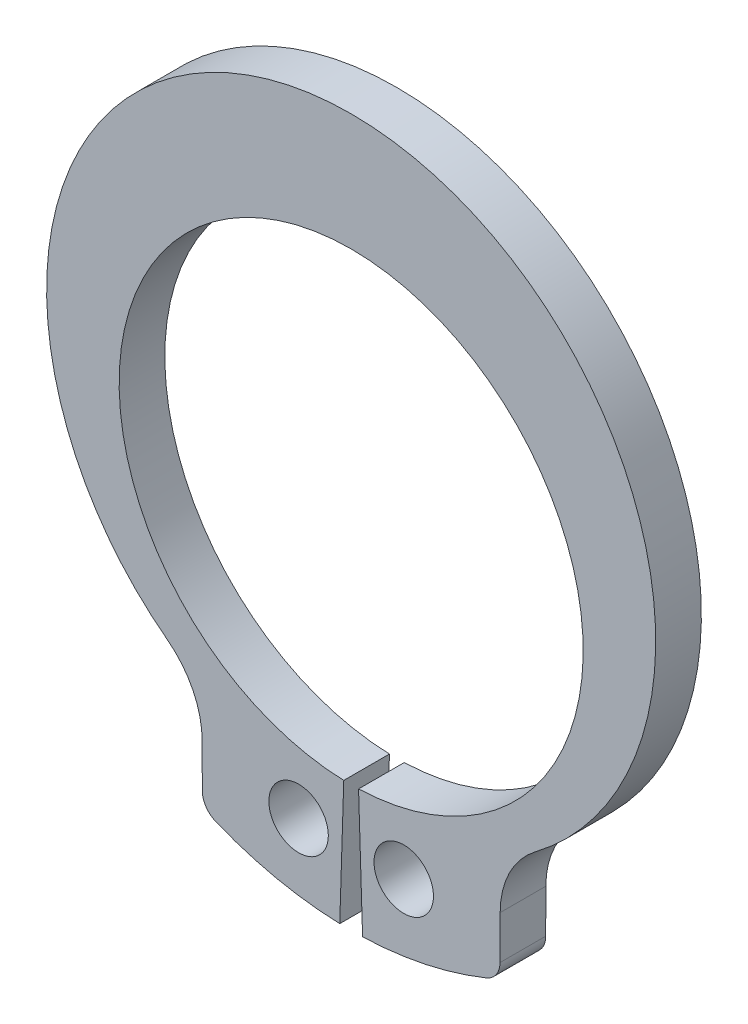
from build123d import *

# Parameters (mm, degrees)
BODYSKE_R  = 0.5207
BODY_DEPTH = 0.799999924


with BuildPart() as part:
    # BodySke → Body (new body)
    with BuildSketch(Plane.XY):
        with BuildLine():
            Line((0.129554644, -4.061934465), (0.199999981, -6.27061133))
            ThreePointArc((0.199999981, -6.27061133), (1.305792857, -6.136405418), (2.370422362, -5.808757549))
            ThreePointArc((2.370422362, -5.808757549), (2.542405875, -5.668943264), (2.607468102, -5.457062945))
            Line((2.607468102, -5.457062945), (2.609588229, -4.697850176))
            ThreePointArc((2.609588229, -4.697850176), (2.771848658, -4.013197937), (3.221096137, -3.471668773))
            ThreePointArc((3.221096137, -3.471668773), (0, 6.113930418), (-3.221096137, -3.471668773))
            ThreePointArc((-3.221096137, -3.471668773), (-2.771848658, -4.013197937), (-2.609588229, -4.697850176))
            Line((-2.609588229, -4.697850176), (-2.607468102, -5.457062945))
            ThreePointArc((-2.607468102, -5.457062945), (-2.542405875, -5.668943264), (-2.370422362, -5.808757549))
            ThreePointArc((-2.370422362, -5.808757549), (-1.305792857, -6.136405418), (-0.199999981, -6.27061133))
            Line((-0.199999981, -6.27061133), (-0.129554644, -4.061934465))
            ThreePointArc((-0.129554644, -4.061934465), (0, 4.064), (0.129554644, -4.061934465))
        make_face()
        with Locations((0.920699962, -5.03460616)):
            Circle(BODYSKE_R, mode=Mode.SUBTRACT)
        with Locations((-0.920699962, -5.03460616)):
            Circle(BODYSKE_R, mode=Mode.SUBTRACT)
    extrude(amount=-BODY_DEPTH)


solid = part.part
